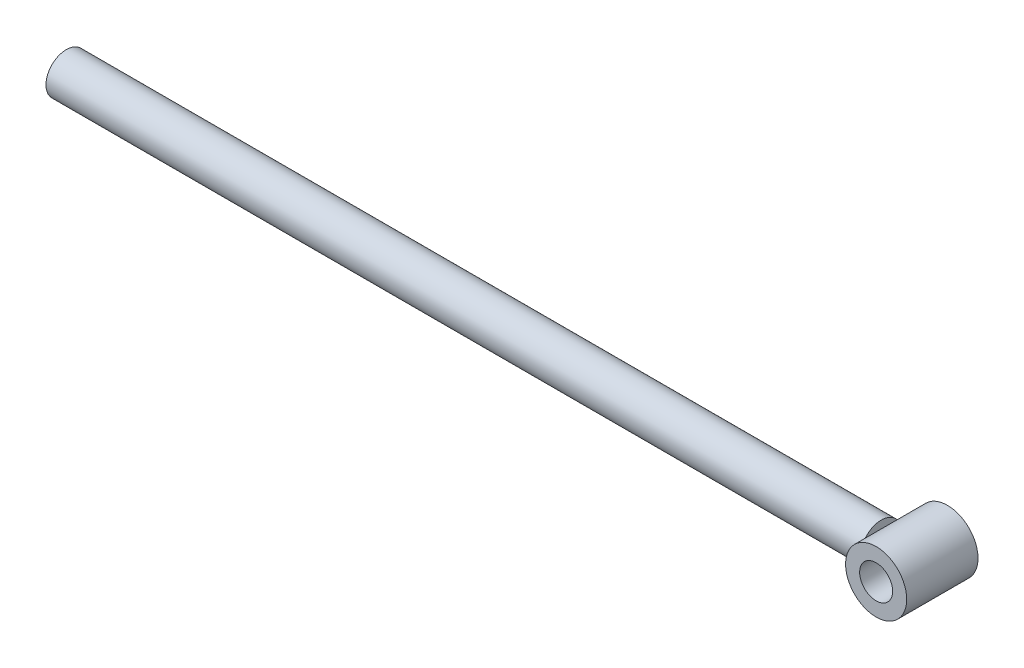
from build123d import *

# Parameters (mm, degrees)
ESQUISSE1_R      = 10
EXTRUSION1_DEPTH = 400
ESQUISSE2_R      = 15
ESQUISSE2_R_2    = 8.1
EXTRUSION2_DEPTH = 17.5


with BuildPart() as part:
    # Esquisse1 → Extrusion1 (new body)
    with BuildSketch(Plane(origin=(0, 0, 0), x_dir=(0, 0, -1), z_dir=(1, 0, 0))):
        Circle(ESQUISSE1_R)
    extrude(amount=EXTRUSION1_DEPTH)


with BuildPart() as body_2:
    # Esquisse2 → Extrusion2 (new, symmetric)
    with BuildSketch(Plane.XY):
        with Locations((415, 0)):
            Circle(ESQUISSE2_R)
        with Locations((415, 0)):
            Circle(ESQUISSE2_R_2, mode=Mode.SUBTRACT)
    extrude(amount=EXTRUSION2_DEPTH, both=True)


solid = Compound([part.part, body_2.part])
